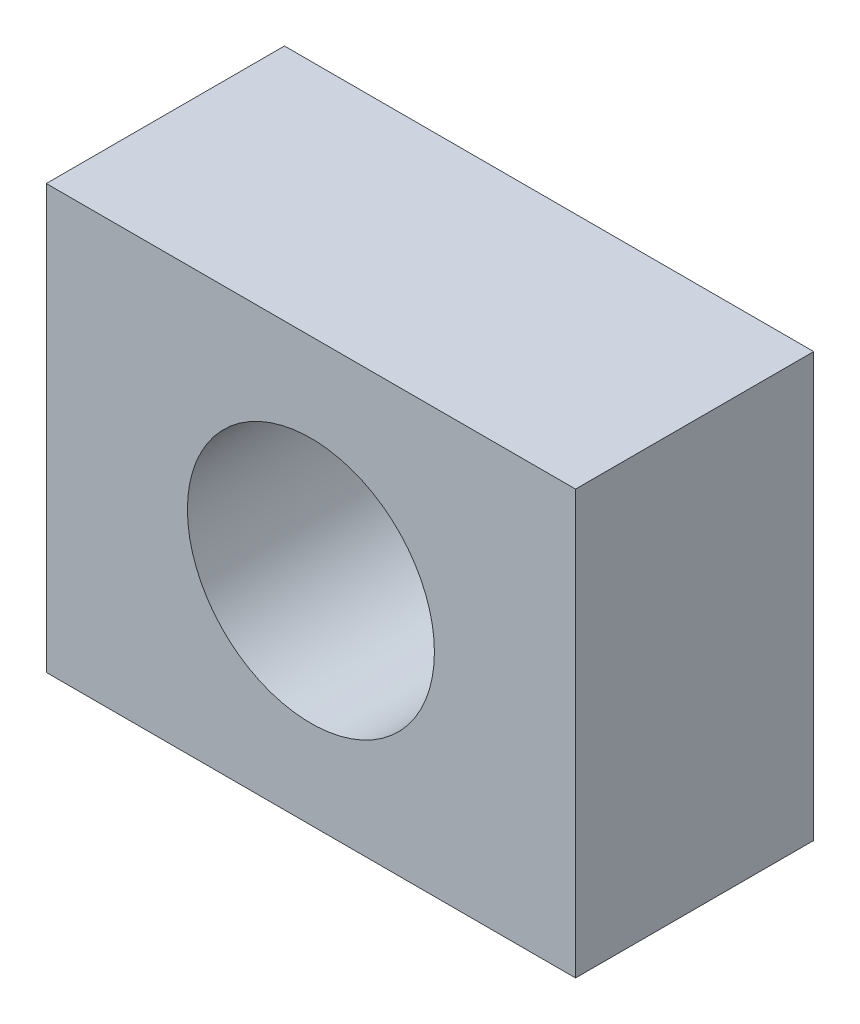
ISO-10303-21;
HEADER;
FILE_DESCRIPTION(('STEP AP214'),'2;1');
FILE_NAME('part.step','',(''),(''),'','','');
FILE_SCHEMA(('AUTOMOTIVE_DESIGN { 1 0 10303 214 1 1 1 1 }'));
ENDSEC;
DATA;
#1=APPLICATION_CONTEXT('core data for automotive mechanical design processes');
#2=APPLICATION_PROTOCOL_DEFINITION('international standard','automotive_design',2000,#1);
#3=PRODUCT_CONTEXT('',#1,'mechanical');
#4=PRODUCT('Part','Part','',(#3));
#5=PRODUCT_RELATED_PRODUCT_CATEGORY('part','',(#4));
#6=PRODUCT_DEFINITION_FORMATION('','',#4);
#7=PRODUCT_DEFINITION_CONTEXT('part definition',#1,'design');
#8=PRODUCT_DEFINITION('design','',#6,#7);
#9=PRODUCT_DEFINITION_SHAPE('','',#8);
#10=(LENGTH_UNIT() NAMED_UNIT(*) SI_UNIT(.MILLI.,.METRE.));
#11=(NAMED_UNIT(*) PLANE_ANGLE_UNIT() SI_UNIT($,.RADIAN.));
#12=(NAMED_UNIT(*) SI_UNIT($,.STERADIAN.) SOLID_ANGLE_UNIT());
#13=UNCERTAINTY_MEASURE_WITH_UNIT(LENGTH_MEASURE(1.E-05),#10,'distance_accuracy_value','');
#14=(GEOMETRIC_REPRESENTATION_CONTEXT(3) GLOBAL_UNCERTAINTY_ASSIGNED_CONTEXT((#13)) GLOBAL_UNIT_ASSIGNED_CONTEXT((#10,
#11,#12)) REPRESENTATION_CONTEXT('',''));
#15=CARTESIAN_POINT('',(0.,0.,0.));
#16=DIRECTION('',(0.,0.,1.));
#17=DIRECTION('',(1.,0.,0.));
#18=AXIS2_PLACEMENT_3D('',#15,#16,#17);
#19=CARTESIAN_POINT('',(15.,-12.,0.));
#20=DIRECTION('',(1.,0.,0.));
#21=DIRECTION('',(0.,0.,-1.));
#22=AXIS2_PLACEMENT_3D('',#19,#20,#21);
#23=PLANE('',#22);
#24=DIRECTION('',(0.,1.,0.));
#25=VECTOR('',#24,1.);
#26=CARTESIAN_POINT('',(15.,-12.,13.5));
#27=LINE('',#26,#25);
#28=CARTESIAN_POINT('',(15.,-12.,13.5));
#29=VERTEX_POINT('',#28);
#30=CARTESIAN_POINT('',(15.,12.,13.5));
#31=VERTEX_POINT('',#30);
#32=EDGE_CURVE('E75',#29,#31,#27,.T.);
#33=ORIENTED_EDGE('',*,*,#32,.F.);
#34=DIRECTION('',(0.,0.,1.));
#35=VECTOR('',#34,1.);
#36=CARTESIAN_POINT('',(15.,-12.,0.));
#37=LINE('',#36,#35);
#38=CARTESIAN_POINT('',(15.,-12.,0.));
#39=VERTEX_POINT('',#38);
#40=EDGE_CURVE('E11',#39,#29,#37,.T.);
#41=ORIENTED_EDGE('',*,*,#40,.F.);
#42=DIRECTION('',(0.,1.,0.));
#43=VECTOR('',#42,1.);
#44=CARTESIAN_POINT('',(15.,-12.,0.));
#45=LINE('',#44,#43);
#46=CARTESIAN_POINT('',(15.,12.,0.));
#47=VERTEX_POINT('',#46);
#48=EDGE_CURVE('E77',#39,#47,#45,.T.);
#49=ORIENTED_EDGE('',*,*,#48,.T.);
#50=DIRECTION('',(0.,0.,1.));
#51=VECTOR('',#50,1.);
#52=CARTESIAN_POINT('',(15.,12.,0.));
#53=LINE('',#52,#51);
#54=EDGE_CURVE('E38',#47,#31,#53,.T.);
#55=ORIENTED_EDGE('',*,*,#54,.T.);
#56=EDGE_LOOP('',(#33,#41,#49,#55));
#57=FACE_BOUND('',#56,.T.);
#58=ADVANCED_FACE('F35',(#57),#23,.T.);
#59=CARTESIAN_POINT('',(-15.,-12.,0.));
#60=DIRECTION('',(0.,-1.,0.));
#61=DIRECTION('',(0.,0.,-1.));
#62=AXIS2_PLACEMENT_3D('',#59,#60,#61);
#63=PLANE('',#62);
#64=DIRECTION('',(1.,0.,0.));
#65=VECTOR('',#64,1.);
#66=CARTESIAN_POINT('',(-15.,-12.,13.5));
#67=LINE('',#66,#65);
#68=CARTESIAN_POINT('',(-15.,-12.,13.5));
#69=VERTEX_POINT('',#68);
#70=EDGE_CURVE('E92',#69,#29,#67,.T.);
#71=ORIENTED_EDGE('',*,*,#70,.F.);
#72=DIRECTION('',(0.,0.,1.));
#73=VECTOR('',#72,1.);
#74=CARTESIAN_POINT('',(-15.,-12.,0.));
#75=LINE('',#74,#73);
#76=CARTESIAN_POINT('',(-15.,-12.,0.));
#77=VERTEX_POINT('',#76);
#78=EDGE_CURVE('E43',#77,#69,#75,.T.);
#79=ORIENTED_EDGE('',*,*,#78,.F.);
#80=DIRECTION('',(1.,0.,0.));
#81=VECTOR('',#80,1.);
#82=CARTESIAN_POINT('',(-15.,-12.,0.));
#83=LINE('',#82,#81);
#84=EDGE_CURVE('E82',#77,#39,#83,.T.);
#85=ORIENTED_EDGE('',*,*,#84,.T.);
#86=ORIENTED_EDGE('',*,*,#40,.T.);
#87=EDGE_LOOP('',(#71,#79,#85,#86));
#88=FACE_BOUND('',#87,.T.);
#89=ADVANCED_FACE('F112',(#88),#63,.T.);
#90=CARTESIAN_POINT('',(-15.,12.,0.));
#91=DIRECTION('',(-1.,0.,0.));
#92=DIRECTION('',(0.,0.,1.));
#93=AXIS2_PLACEMENT_3D('',#90,#91,#92);
#94=PLANE('',#93);
#95=DIRECTION('',(0.,-1.,0.));
#96=VECTOR('',#95,1.);
#97=CARTESIAN_POINT('',(-15.,12.,13.5));
#98=LINE('',#97,#96);
#99=CARTESIAN_POINT('',(-15.,12.,13.5));
#100=VERTEX_POINT('',#99);
#101=EDGE_CURVE('E89',#100,#69,#98,.T.);
#102=ORIENTED_EDGE('',*,*,#101,.F.);
#103=DIRECTION('',(0.,0.,1.));
#104=VECTOR('',#103,1.);
#105=CARTESIAN_POINT('',(-15.,12.,0.));
#106=LINE('',#105,#104);
#107=CARTESIAN_POINT('',(-15.,12.,0.));
#108=VERTEX_POINT('',#107);
#109=EDGE_CURVE('E81',#108,#100,#106,.T.);
#110=ORIENTED_EDGE('',*,*,#109,.F.);
#111=DIRECTION('',(0.,-1.,0.));
#112=VECTOR('',#111,1.);
#113=CARTESIAN_POINT('',(-15.,12.,0.));
#114=LINE('',#113,#112);
#115=EDGE_CURVE('E105',#108,#77,#114,.T.);
#116=ORIENTED_EDGE('',*,*,#115,.T.);
#117=ORIENTED_EDGE('',*,*,#78,.T.);
#118=EDGE_LOOP('',(#102,#110,#116,#117));
#119=FACE_BOUND('',#118,.T.);
#120=ADVANCED_FACE('F109',(#119),#94,.T.);
#121=CARTESIAN_POINT('',(15.,12.,0.));
#122=DIRECTION('',(0.,1.,0.));
#123=DIRECTION('',(0.,0.,1.));
#124=AXIS2_PLACEMENT_3D('',#121,#122,#123);
#125=PLANE('',#124);
#126=DIRECTION('',(-1.,0.,0.));
#127=VECTOR('',#126,1.);
#128=CARTESIAN_POINT('',(15.,12.,13.5));
#129=LINE('',#128,#127);
#130=EDGE_CURVE('E84',#31,#100,#129,.T.);
#131=ORIENTED_EDGE('',*,*,#130,.F.);
#132=ORIENTED_EDGE('',*,*,#54,.F.);
#133=DIRECTION('',(-1.,0.,0.));
#134=VECTOR('',#133,1.);
#135=CARTESIAN_POINT('',(15.,12.,0.));
#136=LINE('',#135,#134);
#137=EDGE_CURVE('E103',#47,#108,#136,.T.);
#138=ORIENTED_EDGE('',*,*,#137,.T.);
#139=ORIENTED_EDGE('',*,*,#109,.T.);
#140=EDGE_LOOP('',(#131,#132,#138,#139));
#141=FACE_BOUND('',#140,.T.);
#142=ADVANCED_FACE('F85',(#141),#125,.T.);
#143=CARTESIAN_POINT('',(15.,12.,0.));
#144=DIRECTION('',(0.,0.,1.));
#145=DIRECTION('',(1.,0.,0.));
#146=AXIS2_PLACEMENT_3D('',#143,#144,#145);
#147=PLANE('',#146);
#148=CARTESIAN_POINT('',(0.,0.,0.));
#149=DIRECTION('',(0.,0.,1.));
#150=DIRECTION('',(-1.,0.,0.));
#151=AXIS2_PLACEMENT_3D('',#148,#149,#150);
#152=CIRCLE('',#151,7.);
#153=CARTESIAN_POINT('',(-7.,0.,0.));
#154=VERTEX_POINT('',#153);
#155=EDGE_CURVE('E93',#154,#154,#152,.T.);
#156=ORIENTED_EDGE('',*,*,#155,.T.);
#157=EDGE_LOOP('',(#156));
#158=FACE_BOUND('',#157,.T.);
#159=ORIENTED_EDGE('',*,*,#48,.F.);
#160=ORIENTED_EDGE('',*,*,#84,.F.);
#161=ORIENTED_EDGE('',*,*,#115,.F.);
#162=ORIENTED_EDGE('',*,*,#137,.F.);
#163=EDGE_LOOP('',(#159,#160,#161,#162));
#164=FACE_BOUND('',#163,.T.);
#165=ADVANCED_FACE('F114',(#158,#164),#147,.F.);
#166=CARTESIAN_POINT('',(15.,12.,13.5));
#167=DIRECTION('',(0.,0.,1.));
#168=DIRECTION('',(1.,0.,0.));
#169=AXIS2_PLACEMENT_3D('',#166,#167,#168);
#170=PLANE('',#169);
#171=CARTESIAN_POINT('',(0.,0.,13.5));
#172=DIRECTION('',(0.,0.,1.));
#173=DIRECTION('',(-1.,0.,0.));
#174=AXIS2_PLACEMENT_3D('',#171,#172,#173);
#175=CIRCLE('',#174,7.);
#176=CARTESIAN_POINT('',(-7.,0.,13.5));
#177=VERTEX_POINT('',#176);
#178=EDGE_CURVE('E96',#177,#177,#175,.T.);
#179=ORIENTED_EDGE('',*,*,#178,.F.);
#180=EDGE_LOOP('',(#179));
#181=FACE_BOUND('',#180,.T.);
#182=ORIENTED_EDGE('',*,*,#32,.T.);
#183=ORIENTED_EDGE('',*,*,#130,.T.);
#184=ORIENTED_EDGE('',*,*,#101,.T.);
#185=ORIENTED_EDGE('',*,*,#70,.T.);
#186=EDGE_LOOP('',(#182,#183,#184,#185));
#187=FACE_BOUND('',#186,.T.);
#188=ADVANCED_FACE('F91',(#181,#187),#170,.T.);
#189=CARTESIAN_POINT('',(0.,0.,0.));
#190=DIRECTION('',(0.,0.,1.));
#191=DIRECTION('',(1.,0.,0.));
#192=AXIS2_PLACEMENT_3D('',#189,#190,#191);
#193=CYLINDRICAL_SURFACE('',#192,7.);
#194=ORIENTED_EDGE('',*,*,#155,.F.);
#195=EDGE_LOOP('',(#194));
#196=FACE_BOUND('',#195,.T.);
#197=ORIENTED_EDGE('',*,*,#178,.T.);
#198=EDGE_LOOP('',(#197));
#199=FACE_BOUND('',#198,.T.);
#200=ADVANCED_FACE('F122',(#196,#199),#193,.F.);
#201=CLOSED_SHELL('',(#58,#89,#120,#142,#165,#188,#200));
#202=MANIFOLD_SOLID_BREP('B2',#201);
#203=ADVANCED_BREP_SHAPE_REPRESENTATION('',(#18,#202),#14);
#204=SHAPE_DEFINITION_REPRESENTATION(#9,#203);
ENDSEC;
END-ISO-10303-21;
